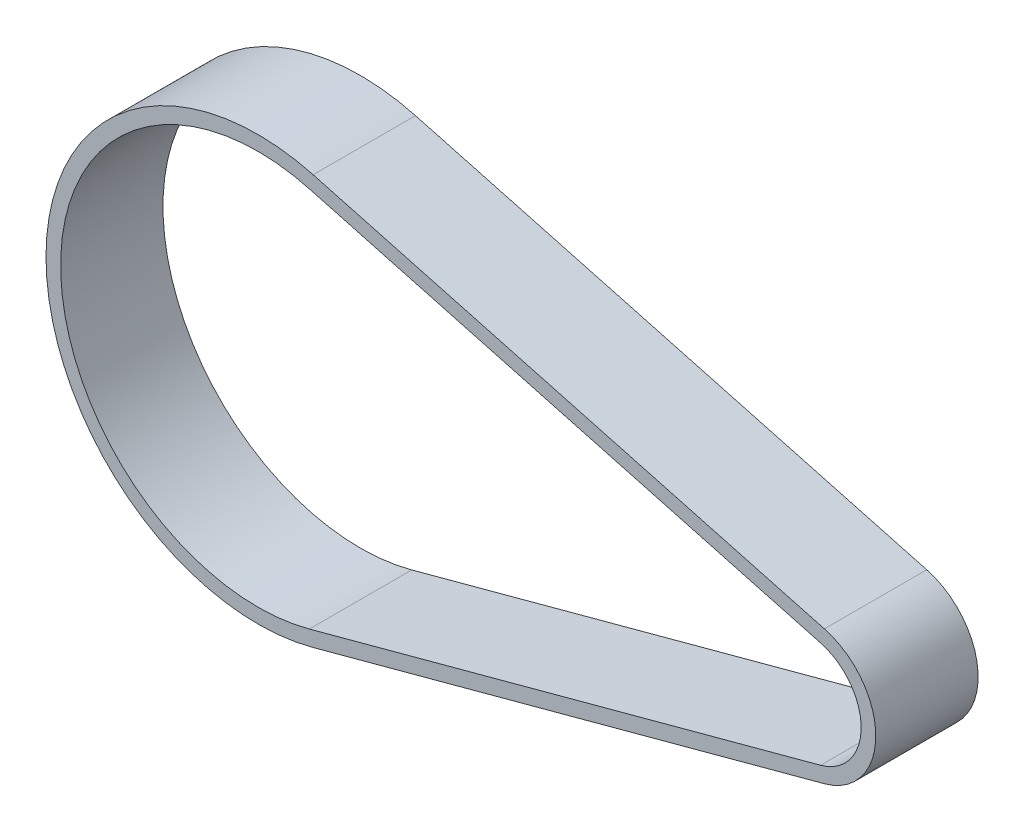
from build123d import *

# Parameters (mm, degrees)
EXTRU_MINCE1_DEPTH = 14


with BuildPart() as part:
    # Esquisse1 → Extru.-Mince1 (new body)
    with BuildSketch(Plane.XY):
        with BuildLine():
            Line((7.54, 28.002649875), (77.47, 9.173281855))
            ThreePointArc((77.47, 9.173281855), (84.5, 0), (77.47, -9.173281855))
            Line((77.47, -9.173281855), (7.54, -28.002649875))
            ThreePointArc((7.54, -28.002649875), (-29, 0), (7.54, 28.002649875))
        make_face()
        with BuildLine():
            Line((7.02, 26.071432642), (76.95, 7.242064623))
            ThreePointArc((76.95, 7.242064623), (82.5, 0), (76.95, -7.242064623))
            Line((76.95, -7.242064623), (7.02, -26.071432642))
            ThreePointArc((7.02, -26.071432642), (-27, 0), (7.02, 26.071432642))
        make_face(mode=Mode.SUBTRACT)
    extrude(amount=EXTRU_MINCE1_DEPTH)


solid = part.part
